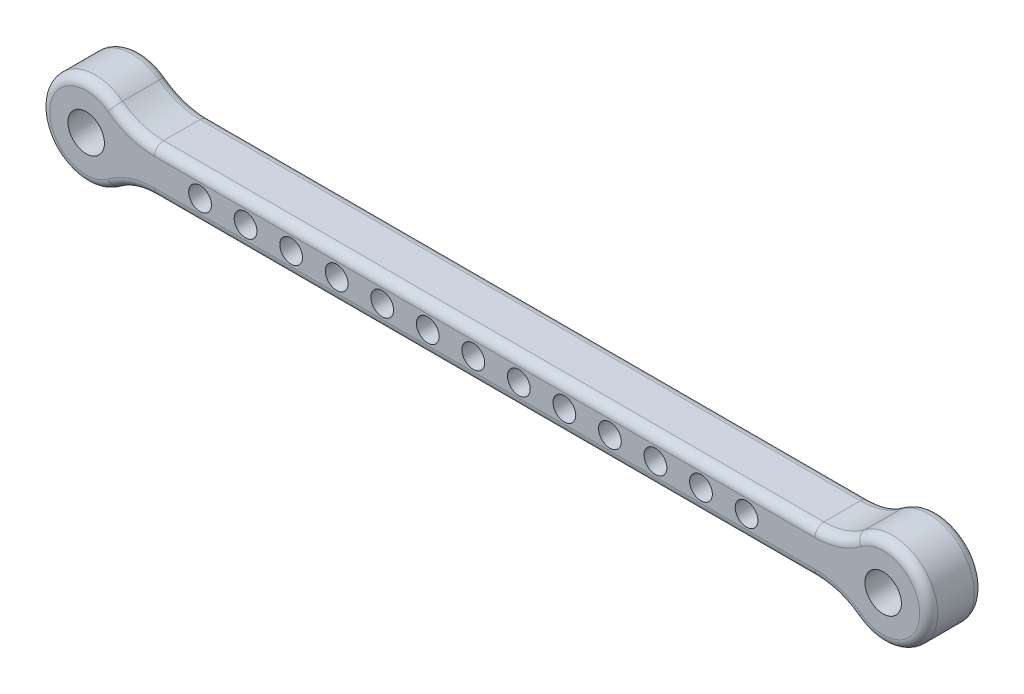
from build123d import *

# Parameters (mm, degrees)
IZIM1_R                     = 4
IZIM1_R_2                   = 2.5
Y_KSEKLIK_EKSTR_ZYON1_DEPTH = 12
RADYUS1_R                   = 2


with BuildPart() as part:
    # izim1 → Y_kseklik-Ekstr_zyon1 (new body)
    with BuildSketch(Plane.XY):
        with BuildLine():
            Line((-160, -5), (-15, -5))
            ThreePointArc((-15, -5), (-10.25658351, -5.769750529), (-6, -8))
            ThreePointArc((-6, -8), (10, 0), (-6, 8))
            ThreePointArc((-6, 8), (-10.25658351, 5.769750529), (-15, 5))
            Line((-15, 5), (-160, 5))
            ThreePointArc((-160, 5), (-164.74341649, 5.769750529), (-169, 8))
            ThreePointArc((-169, 8), (-185, 0), (-169, -8))
            ThreePointArc((-169, -8), (-164.74341649, -5.769750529), (-160, -5))
        make_face()
        with Locations((-175, 0)):
            Circle(IZIM1_R, mode=Mode.SUBTRACT)
        Circle(IZIM1_R, mode=Mode.SUBTRACT)
        with Locations((-150, 0)):
            Circle(IZIM1_R_2, mode=Mode.SUBTRACT)
        with Locations((-140, 0)):
            Circle(IZIM1_R_2, mode=Mode.SUBTRACT)
        with Locations((-130, 0)):
            Circle(IZIM1_R_2, mode=Mode.SUBTRACT)
        with Locations((-120, 0)):
            Circle(IZIM1_R_2, mode=Mode.SUBTRACT)
        with Locations((-110, 0)):
            Circle(IZIM1_R_2, mode=Mode.SUBTRACT)
        with Locations((-100, 0)):
            Circle(IZIM1_R_2, mode=Mode.SUBTRACT)
        with Locations((-90, 0)):
            Circle(IZIM1_R_2, mode=Mode.SUBTRACT)
        with Locations((-80, 0)):
            Circle(IZIM1_R_2, mode=Mode.SUBTRACT)
        with Locations((-70, 0)):
            Circle(IZIM1_R_2, mode=Mode.SUBTRACT)
        with Locations((-60, 0)):
            Circle(IZIM1_R_2, mode=Mode.SUBTRACT)
        with Locations((-50, 0)):
            Circle(IZIM1_R_2, mode=Mode.SUBTRACT)
        with Locations((-40, 0)):
            Circle(IZIM1_R_2, mode=Mode.SUBTRACT)
        with Locations((-30, 0)):
            Circle(IZIM1_R_2, mode=Mode.SUBTRACT)
    extrude(amount=Y_KSEKLIK_EKSTR_ZYON1_DEPTH)

    # Radyus1
    radyus1_edges = [part.edges().sort_by_distance(p)[0] for p in [
        (-185, 0, 0),
        (-164.74341649, 5.769750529, 0),
        (-87.5, 5, 0),
        (-10.25658351, 5.769750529, 0),
        (-164.74341649, 5.769750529, 12),
        (-185, 0, 12),
        (-164.74341649, -5.769750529, 12),
        (-87.5, -5, 12),
        (-10.25658351, -5.769750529, 12),
        (10, 0, 12),
        (-10.25658351, 5.769750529, 12),
        (10, 0, 0),
        (-87.5, 5, 12),
        (-10.25658351, -5.769750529, 0),
        (-87.5, -5, 0),
        (-164.74341649, -5.769750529, 0),
    ]]
    fillet(radyus1_edges, radius=RADYUS1_R)


solid = part.part
